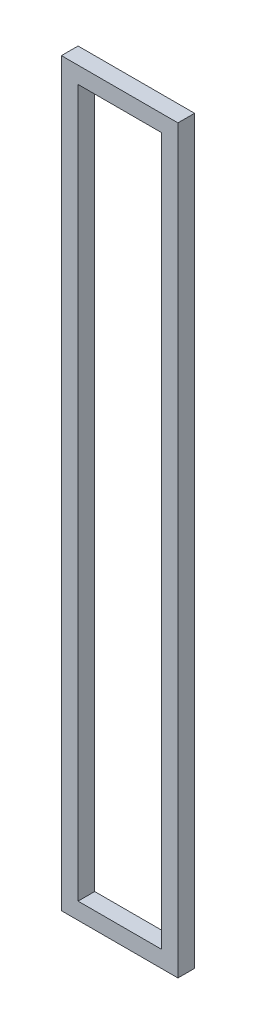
ISO-10303-21;
HEADER;
FILE_DESCRIPTION(('STEP AP214'),'2;1');
FILE_NAME('part.step','',(''),(''),'','','');
FILE_SCHEMA(('AUTOMOTIVE_DESIGN { 1 0 10303 214 1 1 1 1 }'));
ENDSEC;
DATA;
#1=APPLICATION_CONTEXT('core data for automotive mechanical design processes');
#2=APPLICATION_PROTOCOL_DEFINITION('international standard','automotive_design',2000,#1);
#3=PRODUCT_CONTEXT('',#1,'mechanical');
#4=PRODUCT('Part','Part','',(#3));
#5=PRODUCT_RELATED_PRODUCT_CATEGORY('part','',(#4));
#6=PRODUCT_DEFINITION_FORMATION('','',#4);
#7=PRODUCT_DEFINITION_CONTEXT('part definition',#1,'design');
#8=PRODUCT_DEFINITION('design','',#6,#7);
#9=PRODUCT_DEFINITION_SHAPE('','',#8);
#10=(LENGTH_UNIT() NAMED_UNIT(*) SI_UNIT(.MILLI.,.METRE.));
#11=(NAMED_UNIT(*) PLANE_ANGLE_UNIT() SI_UNIT($,.RADIAN.));
#12=(NAMED_UNIT(*) SI_UNIT($,.STERADIAN.) SOLID_ANGLE_UNIT());
#13=UNCERTAINTY_MEASURE_WITH_UNIT(LENGTH_MEASURE(1.E-05),#10,'distance_accuracy_value','');
#14=(GEOMETRIC_REPRESENTATION_CONTEXT(3) GLOBAL_UNCERTAINTY_ASSIGNED_CONTEXT((#13)) GLOBAL_UNIT_ASSIGNED_CONTEXT((#10,
#11,#12)) REPRESENTATION_CONTEXT('',''));
#15=CARTESIAN_POINT('',(0.,0.,0.));
#16=DIRECTION('',(0.,0.,1.));
#17=DIRECTION('',(1.,0.,0.));
#18=AXIS2_PLACEMENT_3D('',#15,#16,#17);
#19=CARTESIAN_POINT('',(-2.54,110.49,2.54));
#20=DIRECTION('',(0.,0.,-1.));
#21=DIRECTION('',(-1.,0.,0.));
#22=AXIS2_PLACEMENT_3D('',#19,#20,#21);
#23=PLANE('',#22);
#24=DIRECTION('',(0.,-1.,0.));
#25=VECTOR('',#24,1.);
#26=CARTESIAN_POINT('',(-2.54,-2.54,2.54));
#27=LINE('',#26,#25);
#28=CARTESIAN_POINT('',(-2.54,110.49,2.54));
#29=VERTEX_POINT('',#28);
#30=CARTESIAN_POINT('',(-2.54,-2.54,2.54));
#31=VERTEX_POINT('',#30);
#32=EDGE_CURVE('E132',#29,#31,#27,.T.);
#33=ORIENTED_EDGE('',*,*,#32,.T.);
#34=DIRECTION('',(1.,0.,0.));
#35=VECTOR('',#34,1.);
#36=CARTESIAN_POINT('',(-2.54,-2.54,2.54));
#37=LINE('',#36,#35);
#38=CARTESIAN_POINT('',(15.24,-2.54,2.54));
#39=VERTEX_POINT('',#38);
#40=EDGE_CURVE('E135',#31,#39,#37,.T.);
#41=ORIENTED_EDGE('',*,*,#40,.T.);
#42=DIRECTION('',(0.,1.,0.));
#43=VECTOR('',#42,1.);
#44=CARTESIAN_POINT('',(15.24,-2.54,2.54));
#45=LINE('',#44,#43);
#46=CARTESIAN_POINT('',(15.24,110.49,2.54));
#47=VERTEX_POINT('',#46);
#48=EDGE_CURVE('E138',#39,#47,#45,.T.);
#49=ORIENTED_EDGE('',*,*,#48,.T.);
#50=DIRECTION('',(-1.,0.,0.));
#51=VECTOR('',#50,1.);
#52=CARTESIAN_POINT('',(-2.54,110.49,2.54));
#53=LINE('',#52,#51);
#54=EDGE_CURVE('E140',#47,#29,#53,.T.);
#55=ORIENTED_EDGE('',*,*,#54,.T.);
#56=EDGE_LOOP('',(#33,#41,#49,#55));
#57=FACE_BOUND('',#56,.T.);
#58=DIRECTION('',(0.,-1.,0.));
#59=VECTOR('',#58,1.);
#60=CARTESIAN_POINT('',(0.,0.,2.54));
#61=LINE('',#60,#59);
#62=CARTESIAN_POINT('',(0.,107.95,2.54));
#63=VERTEX_POINT('',#62);
#64=CARTESIAN_POINT('',(0.,0.,2.54));
#65=VERTEX_POINT('',#64);
#66=EDGE_CURVE('E96',#63,#65,#61,.T.);
#67=ORIENTED_EDGE('',*,*,#66,.F.);
#68=DIRECTION('',(-1.,0.,0.));
#69=VECTOR('',#68,1.);
#70=CARTESIAN_POINT('',(0.,107.95,2.54));
#71=LINE('',#70,#69);
#72=CARTESIAN_POINT('',(12.7,107.95,2.54));
#73=VERTEX_POINT('',#72);
#74=EDGE_CURVE('E118',#73,#63,#71,.T.);
#75=ORIENTED_EDGE('',*,*,#74,.F.);
#76=DIRECTION('',(0.,1.,0.));
#77=VECTOR('',#76,1.);
#78=CARTESIAN_POINT('',(12.7,0.,2.54));
#79=LINE('',#78,#77);
#80=CARTESIAN_POINT('',(12.7,0.,2.54));
#81=VERTEX_POINT('',#80);
#82=EDGE_CURVE('E116',#81,#73,#79,.T.);
#83=ORIENTED_EDGE('',*,*,#82,.F.);
#84=DIRECTION('',(1.,0.,0.));
#85=VECTOR('',#84,1.);
#86=CARTESIAN_POINT('',(0.,0.,2.54));
#87=LINE('',#86,#85);
#88=EDGE_CURVE('E104',#65,#81,#87,.T.);
#89=ORIENTED_EDGE('',*,*,#88,.F.);
#90=EDGE_LOOP('',(#67,#75,#83,#89));
#91=FACE_BOUND('',#90,.T.);
#92=ADVANCED_FACE('F31',(#57,#91),#23,.F.);
#93=CARTESIAN_POINT('',(-2.54,110.49,0.));
#94=DIRECTION('',(0.,0.,-1.));
#95=DIRECTION('',(-1.,0.,0.));
#96=AXIS2_PLACEMENT_3D('',#93,#94,#95);
#97=PLANE('',#96);
#98=DIRECTION('',(0.,-1.,0.));
#99=VECTOR('',#98,1.);
#100=CARTESIAN_POINT('',(-2.54,-2.54,0.));
#101=LINE('',#100,#99);
#102=CARTESIAN_POINT('',(-2.54,110.49,0.));
#103=VERTEX_POINT('',#102);
#104=CARTESIAN_POINT('',(-2.54,-2.54,0.));
#105=VERTEX_POINT('',#104);
#106=EDGE_CURVE('E112',#103,#105,#101,.T.);
#107=ORIENTED_EDGE('',*,*,#106,.F.);
#108=DIRECTION('',(-1.,0.,0.));
#109=VECTOR('',#108,1.);
#110=CARTESIAN_POINT('',(-2.54,110.49,0.));
#111=LINE('',#110,#109);
#112=CARTESIAN_POINT('',(15.24,110.49,0.));
#113=VERTEX_POINT('',#112);
#114=EDGE_CURVE('E136',#113,#103,#111,.T.);
#115=ORIENTED_EDGE('',*,*,#114,.F.);
#116=DIRECTION('',(0.,1.,0.));
#117=VECTOR('',#116,1.);
#118=CARTESIAN_POINT('',(15.24,-2.54,0.));
#119=LINE('',#118,#117);
#120=CARTESIAN_POINT('',(15.24,-2.54,0.));
#121=VERTEX_POINT('',#120);
#122=EDGE_CURVE('E147',#121,#113,#119,.T.);
#123=ORIENTED_EDGE('',*,*,#122,.F.);
#124=DIRECTION('',(1.,0.,0.));
#125=VECTOR('',#124,1.);
#126=CARTESIAN_POINT('',(-2.54,-2.54,0.));
#127=LINE('',#126,#125);
#128=EDGE_CURVE('E145',#105,#121,#127,.T.);
#129=ORIENTED_EDGE('',*,*,#128,.F.);
#130=EDGE_LOOP('',(#107,#115,#123,#129));
#131=FACE_BOUND('',#130,.T.);
#132=DIRECTION('',(-1.,0.,0.));
#133=VECTOR('',#132,1.);
#134=CARTESIAN_POINT('',(0.,107.95,0.));
#135=LINE('',#134,#133);
#136=CARTESIAN_POINT('',(12.7,107.95,0.));
#137=VERTEX_POINT('',#136);
#138=CARTESIAN_POINT('',(0.,107.95,0.));
#139=VERTEX_POINT('',#138);
#140=EDGE_CURVE('E105',#137,#139,#135,.T.);
#141=ORIENTED_EDGE('',*,*,#140,.T.);
#142=DIRECTION('',(0.,-1.,0.));
#143=VECTOR('',#142,1.);
#144=CARTESIAN_POINT('',(0.,0.,0.));
#145=LINE('',#144,#143);
#146=CARTESIAN_POINT('',(0.,0.,0.));
#147=VERTEX_POINT('',#146);
#148=EDGE_CURVE('E54',#139,#147,#145,.T.);
#149=ORIENTED_EDGE('',*,*,#148,.T.);
#150=DIRECTION('',(1.,0.,0.));
#151=VECTOR('',#150,1.);
#152=CARTESIAN_POINT('',(0.,0.,0.));
#153=LINE('',#152,#151);
#154=CARTESIAN_POINT('',(12.7,0.,0.));
#155=VERTEX_POINT('',#154);
#156=EDGE_CURVE('E111',#147,#155,#153,.T.);
#157=ORIENTED_EDGE('',*,*,#156,.T.);
#158=DIRECTION('',(0.,1.,0.));
#159=VECTOR('',#158,1.);
#160=CARTESIAN_POINT('',(12.7,0.,0.));
#161=LINE('',#160,#159);
#162=EDGE_CURVE('E124',#155,#137,#161,.T.);
#163=ORIENTED_EDGE('',*,*,#162,.T.);
#164=EDGE_LOOP('',(#141,#149,#157,#163));
#165=FACE_BOUND('',#164,.T.);
#166=ADVANCED_FACE('F165',(#131,#165),#97,.T.);
#167=CARTESIAN_POINT('',(-2.54,-2.54,2.54));
#168=DIRECTION('',(1.,0.,0.));
#169=DIRECTION('',(0.,0.,-1.));
#170=AXIS2_PLACEMENT_3D('',#167,#168,#169);
#171=PLANE('',#170);
#172=ORIENTED_EDGE('',*,*,#106,.T.);
#173=DIRECTION('',(0.,0.,-1.));
#174=VECTOR('',#173,1.);
#175=CARTESIAN_POINT('',(-2.54,-2.54,2.54));
#176=LINE('',#175,#174);
#177=EDGE_CURVE('E11',#31,#105,#176,.T.);
#178=ORIENTED_EDGE('',*,*,#177,.F.);
#179=ORIENTED_EDGE('',*,*,#32,.F.);
#180=DIRECTION('',(0.,0.,-1.));
#181=VECTOR('',#180,1.);
#182=CARTESIAN_POINT('',(-2.54,110.49,2.54));
#183=LINE('',#182,#181);
#184=EDGE_CURVE('E142',#29,#103,#183,.T.);
#185=ORIENTED_EDGE('',*,*,#184,.T.);
#186=EDGE_LOOP('',(#172,#178,#179,#185));
#187=FACE_BOUND('',#186,.T.);
#188=ADVANCED_FACE('F33',(#187),#171,.F.);
#189=CARTESIAN_POINT('',(-2.54,-2.54,2.54));
#190=DIRECTION('',(0.,1.,0.));
#191=DIRECTION('',(0.,0.,1.));
#192=AXIS2_PLACEMENT_3D('',#189,#190,#191);
#193=PLANE('',#192);
#194=ORIENTED_EDGE('',*,*,#128,.T.);
#195=DIRECTION('',(0.,0.,-1.));
#196=VECTOR('',#195,1.);
#197=CARTESIAN_POINT('',(15.24,-2.54,2.54));
#198=LINE('',#197,#196);
#199=EDGE_CURVE('E39',#39,#121,#198,.T.);
#200=ORIENTED_EDGE('',*,*,#199,.F.);
#201=ORIENTED_EDGE('',*,*,#40,.F.);
#202=ORIENTED_EDGE('',*,*,#177,.T.);
#203=EDGE_LOOP('',(#194,#200,#201,#202));
#204=FACE_BOUND('',#203,.T.);
#205=ADVANCED_FACE('F175',(#204),#193,.F.);
#206=CARTESIAN_POINT('',(15.24,-2.54,2.54));
#207=DIRECTION('',(-1.,0.,0.));
#208=DIRECTION('',(0.,0.,1.));
#209=AXIS2_PLACEMENT_3D('',#206,#207,#208);
#210=PLANE('',#209);
#211=ORIENTED_EDGE('',*,*,#122,.T.);
#212=DIRECTION('',(0.,0.,-1.));
#213=VECTOR('',#212,1.);
#214=CARTESIAN_POINT('',(15.24,110.49,2.54));
#215=LINE('',#214,#213);
#216=EDGE_CURVE('E152',#47,#113,#215,.T.);
#217=ORIENTED_EDGE('',*,*,#216,.F.);
#218=ORIENTED_EDGE('',*,*,#48,.F.);
#219=ORIENTED_EDGE('',*,*,#199,.T.);
#220=EDGE_LOOP('',(#211,#217,#218,#219));
#221=FACE_BOUND('',#220,.T.);
#222=ADVANCED_FACE('F159',(#221),#210,.F.);
#223=CARTESIAN_POINT('',(-2.54,110.49,2.54));
#224=DIRECTION('',(0.,-1.,0.));
#225=DIRECTION('',(0.,0.,-1.));
#226=AXIS2_PLACEMENT_3D('',#223,#224,#225);
#227=PLANE('',#226);
#228=ORIENTED_EDGE('',*,*,#114,.T.);
#229=ORIENTED_EDGE('',*,*,#184,.F.);
#230=ORIENTED_EDGE('',*,*,#54,.F.);
#231=ORIENTED_EDGE('',*,*,#216,.T.);
#232=EDGE_LOOP('',(#228,#229,#230,#231));
#233=FACE_BOUND('',#232,.T.);
#234=ADVANCED_FACE('F169',(#233),#227,.F.);
#235=CARTESIAN_POINT('',(0.,0.,2.54));
#236=DIRECTION('',(1.,0.,0.));
#237=DIRECTION('',(0.,0.,-1.));
#238=AXIS2_PLACEMENT_3D('',#235,#236,#237);
#239=PLANE('',#238);
#240=ORIENTED_EDGE('',*,*,#148,.F.);
#241=DIRECTION('',(0.,0.,-1.));
#242=VECTOR('',#241,1.);
#243=CARTESIAN_POINT('',(0.,107.95,2.54));
#244=LINE('',#243,#242);
#245=EDGE_CURVE('E100',#63,#139,#244,.T.);
#246=ORIENTED_EDGE('',*,*,#245,.F.);
#247=ORIENTED_EDGE('',*,*,#66,.T.);
#248=DIRECTION('',(0.,0.,-1.));
#249=VECTOR('',#248,1.);
#250=CARTESIAN_POINT('',(0.,0.,2.54));
#251=LINE('',#250,#249);
#252=EDGE_CURVE('E99',#65,#147,#251,.T.);
#253=ORIENTED_EDGE('',*,*,#252,.T.);
#254=EDGE_LOOP('',(#240,#246,#247,#253));
#255=FACE_BOUND('',#254,.T.);
#256=ADVANCED_FACE('F98',(#255),#239,.T.);
#257=CARTESIAN_POINT('',(0.,0.,2.54));
#258=DIRECTION('',(0.,1.,0.));
#259=DIRECTION('',(0.,0.,1.));
#260=AXIS2_PLACEMENT_3D('',#257,#258,#259);
#261=PLANE('',#260);
#262=ORIENTED_EDGE('',*,*,#156,.F.);
#263=ORIENTED_EDGE('',*,*,#252,.F.);
#264=ORIENTED_EDGE('',*,*,#88,.T.);
#265=DIRECTION('',(0.,0.,-1.));
#266=VECTOR('',#265,1.);
#267=CARTESIAN_POINT('',(12.7,0.,2.54));
#268=LINE('',#267,#266);
#269=EDGE_CURVE('E113',#81,#155,#268,.T.);
#270=ORIENTED_EDGE('',*,*,#269,.T.);
#271=EDGE_LOOP('',(#262,#263,#264,#270));
#272=FACE_BOUND('',#271,.T.);
#273=ADVANCED_FACE('F108',(#272),#261,.T.);
#274=CARTESIAN_POINT('',(12.7,0.,2.54));
#275=DIRECTION('',(-1.,0.,0.));
#276=DIRECTION('',(0.,0.,1.));
#277=AXIS2_PLACEMENT_3D('',#274,#275,#276);
#278=PLANE('',#277);
#279=ORIENTED_EDGE('',*,*,#162,.F.);
#280=ORIENTED_EDGE('',*,*,#269,.F.);
#281=ORIENTED_EDGE('',*,*,#82,.T.);
#282=DIRECTION('',(0.,0.,-1.));
#283=VECTOR('',#282,1.);
#284=CARTESIAN_POINT('',(12.7,107.95,2.54));
#285=LINE('',#284,#283);
#286=EDGE_CURVE('E46',#73,#137,#285,.T.);
#287=ORIENTED_EDGE('',*,*,#286,.T.);
#288=EDGE_LOOP('',(#279,#280,#281,#287));
#289=FACE_BOUND('',#288,.T.);
#290=ADVANCED_FACE('F198',(#289),#278,.T.);
#291=CARTESIAN_POINT('',(0.,107.95,2.54));
#292=DIRECTION('',(0.,-1.,0.));
#293=DIRECTION('',(0.,0.,-1.));
#294=AXIS2_PLACEMENT_3D('',#291,#292,#293);
#295=PLANE('',#294);
#296=ORIENTED_EDGE('',*,*,#140,.F.);
#297=ORIENTED_EDGE('',*,*,#286,.F.);
#298=ORIENTED_EDGE('',*,*,#74,.T.);
#299=ORIENTED_EDGE('',*,*,#245,.T.);
#300=EDGE_LOOP('',(#296,#297,#298,#299));
#301=FACE_BOUND('',#300,.T.);
#302=ADVANCED_FACE('F202',(#301),#295,.T.);
#303=CLOSED_SHELL('',(#92,#166,#188,#205,#222,#234,#256,#273,#290,#302));
#304=MANIFOLD_SOLID_BREP('B2',#303);
#305=ADVANCED_BREP_SHAPE_REPRESENTATION('',(#18,#304),#14);
#306=SHAPE_DEFINITION_REPRESENTATION(#9,#305);
ENDSEC;
END-ISO-10303-21;
